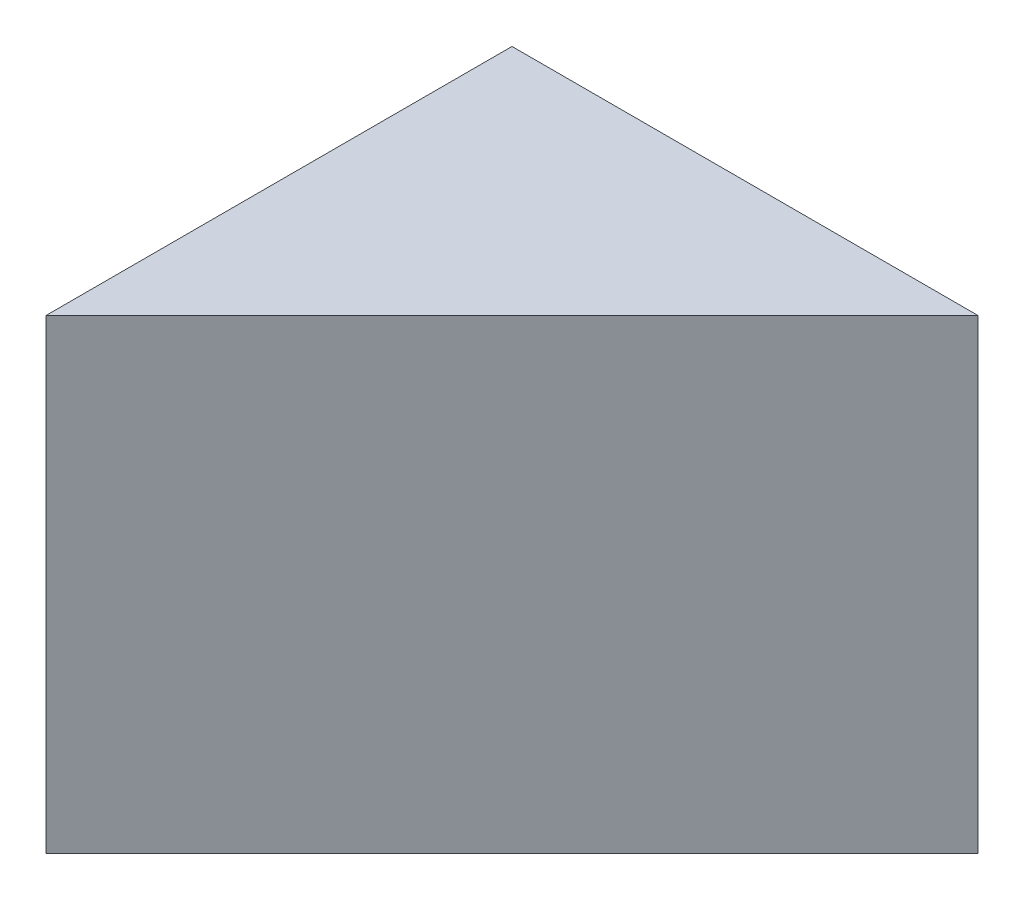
from build123d import *

# Parameters (mm, degrees)
EXTRUDE_1_DEPTH = 60


with BuildPart() as part:
    # Sketch 1 → Extrude 1 (new body)
    with BuildSketch(Plane(origin=(0, 0, 0), x_dir=(1, 0, 0), z_dir=(0, 1, 0))):
        Polygon((-30, 30), (30, 30), (-30, -30), align=None)
    extrude(amount=EXTRUDE_1_DEPTH)


solid = part.part
